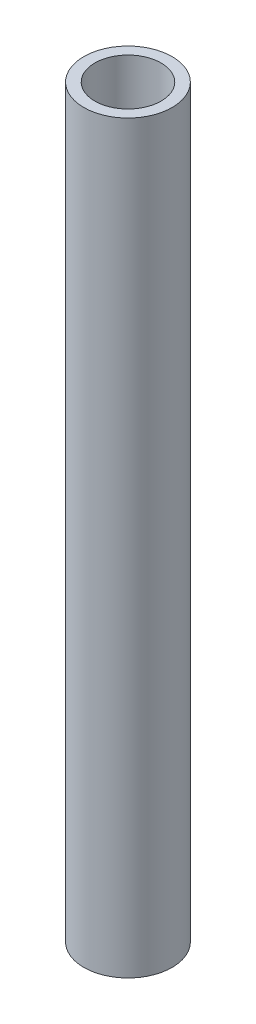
ISO-10303-21;
HEADER;
FILE_DESCRIPTION(('STEP AP214'),'2;1');
FILE_NAME('part.step','',(''),(''),'','','');
FILE_SCHEMA(('AUTOMOTIVE_DESIGN { 1 0 10303 214 1 1 1 1 }'));
ENDSEC;
DATA;
#1=APPLICATION_CONTEXT('core data for automotive mechanical design processes');
#2=APPLICATION_PROTOCOL_DEFINITION('international standard','automotive_design',2000,#1);
#3=PRODUCT_CONTEXT('',#1,'mechanical');
#4=PRODUCT('Part','Part','',(#3));
#5=PRODUCT_RELATED_PRODUCT_CATEGORY('part','',(#4));
#6=PRODUCT_DEFINITION_FORMATION('','',#4);
#7=PRODUCT_DEFINITION_CONTEXT('part definition',#1,'design');
#8=PRODUCT_DEFINITION('design','',#6,#7);
#9=PRODUCT_DEFINITION_SHAPE('','',#8);
#10=(LENGTH_UNIT() NAMED_UNIT(*) SI_UNIT(.MILLI.,.METRE.));
#11=(NAMED_UNIT(*) PLANE_ANGLE_UNIT() SI_UNIT($,.RADIAN.));
#12=(NAMED_UNIT(*) SI_UNIT($,.STERADIAN.) SOLID_ANGLE_UNIT());
#13=UNCERTAINTY_MEASURE_WITH_UNIT(LENGTH_MEASURE(1.E-05),#10,'distance_accuracy_value','');
#14=(GEOMETRIC_REPRESENTATION_CONTEXT(3) GLOBAL_UNCERTAINTY_ASSIGNED_CONTEXT((#13)) GLOBAL_UNIT_ASSIGNED_CONTEXT((#10,
#11,#12)) REPRESENTATION_CONTEXT('',''));
#15=CARTESIAN_POINT('',(0.,0.,0.));
#16=DIRECTION('',(0.,0.,1.));
#17=DIRECTION('',(1.,0.,0.));
#18=AXIS2_PLACEMENT_3D('',#15,#16,#17);
#19=CARTESIAN_POINT('',(0.,135.,0.));
#20=DIRECTION('',(0.,1.,0.));
#21=DIRECTION('',(0.,0.,1.));
#22=AXIS2_PLACEMENT_3D('',#19,#20,#21);
#23=PLANE('',#22);
#24=CARTESIAN_POINT('',(0.,135.,0.));
#25=DIRECTION('',(0.,1.,0.));
#26=DIRECTION('',(0.,0.,1.));
#27=AXIS2_PLACEMENT_3D('',#24,#25,#26);
#28=CIRCLE('',#27,8.);
#29=CARTESIAN_POINT('',(0.,135.,8.));
#30=VERTEX_POINT('',#29);
#31=EDGE_CURVE('E10',#30,#30,#28,.T.);
#32=ORIENTED_EDGE('',*,*,#31,.T.);
#33=EDGE_LOOP('',(#32));
#34=FACE_BOUND('',#33,.T.);
#35=CARTESIAN_POINT('',(0.,135.,0.));
#36=DIRECTION('',(0.,1.,0.));
#37=DIRECTION('',(0.,0.,1.));
#38=AXIS2_PLACEMENT_3D('',#35,#36,#37);
#39=CIRCLE('',#38,6.);
#40=CARTESIAN_POINT('',(0.,135.,6.));
#41=VERTEX_POINT('',#40);
#42=EDGE_CURVE('E50',#41,#41,#39,.T.);
#43=ORIENTED_EDGE('',*,*,#42,.F.);
#44=EDGE_LOOP('',(#43));
#45=FACE_BOUND('',#44,.T.);
#46=ADVANCED_FACE('F37',(#34,#45),#23,.T.);
#47=CARTESIAN_POINT('',(0.,0.,0.));
#48=DIRECTION('',(0.,1.,0.));
#49=DIRECTION('',(0.,0.,1.));
#50=AXIS2_PLACEMENT_3D('',#47,#48,#49);
#51=PLANE('',#50);
#52=CARTESIAN_POINT('',(0.,0.,0.));
#53=DIRECTION('',(0.,1.,0.));
#54=DIRECTION('',(0.,0.,1.));
#55=AXIS2_PLACEMENT_3D('',#52,#53,#54);
#56=CIRCLE('',#55,8.);
#57=CARTESIAN_POINT('',(0.,0.,8.));
#58=VERTEX_POINT('',#57);
#59=EDGE_CURVE('E41',#58,#58,#56,.T.);
#60=ORIENTED_EDGE('',*,*,#59,.F.);
#61=EDGE_LOOP('',(#60));
#62=FACE_BOUND('',#61,.T.);
#63=CARTESIAN_POINT('',(0.,0.,0.));
#64=DIRECTION('',(0.,1.,0.));
#65=DIRECTION('',(0.,0.,1.));
#66=AXIS2_PLACEMENT_3D('',#63,#64,#65);
#67=CIRCLE('',#66,6.);
#68=CARTESIAN_POINT('',(0.,0.,6.));
#69=VERTEX_POINT('',#68);
#70=EDGE_CURVE('E52',#69,#69,#67,.T.);
#71=ORIENTED_EDGE('',*,*,#70,.T.);
#72=EDGE_LOOP('',(#71));
#73=FACE_BOUND('',#72,.T.);
#74=ADVANCED_FACE('F64',(#62,#73),#51,.F.);
#75=CARTESIAN_POINT('',(0.,135.,0.));
#76=DIRECTION('',(0.,-1.,0.));
#77=DIRECTION('',(0.,0.,-1.));
#78=AXIS2_PLACEMENT_3D('',#75,#76,#77);
#79=CYLINDRICAL_SURFACE('',#78,8.);
#80=ORIENTED_EDGE('',*,*,#31,.F.);
#81=EDGE_LOOP('',(#80));
#82=FACE_BOUND('',#81,.T.);
#83=ORIENTED_EDGE('',*,*,#59,.T.);
#84=EDGE_LOOP('',(#83));
#85=FACE_BOUND('',#84,.T.);
#86=ADVANCED_FACE('F39',(#82,#85),#79,.T.);
#87=CARTESIAN_POINT('',(0.,135.,0.));
#88=DIRECTION('',(0.,-1.,0.));
#89=DIRECTION('',(0.,0.,-1.));
#90=AXIS2_PLACEMENT_3D('',#87,#88,#89);
#91=CYLINDRICAL_SURFACE('',#90,6.);
#92=ORIENTED_EDGE('',*,*,#42,.T.);
#93=EDGE_LOOP('',(#92));
#94=FACE_BOUND('',#93,.T.);
#95=ORIENTED_EDGE('',*,*,#70,.F.);
#96=EDGE_LOOP('',(#95));
#97=FACE_BOUND('',#96,.T.);
#98=ADVANCED_FACE('F60',(#94,#97),#91,.F.);
#99=CLOSED_SHELL('',(#46,#74,#86,#98));
#100=MANIFOLD_SOLID_BREP('B2',#99);
#101=ADVANCED_BREP_SHAPE_REPRESENTATION('',(#18,#100),#14);
#102=SHAPE_DEFINITION_REPRESENTATION(#9,#101);
ENDSEC;
END-ISO-10303-21;
